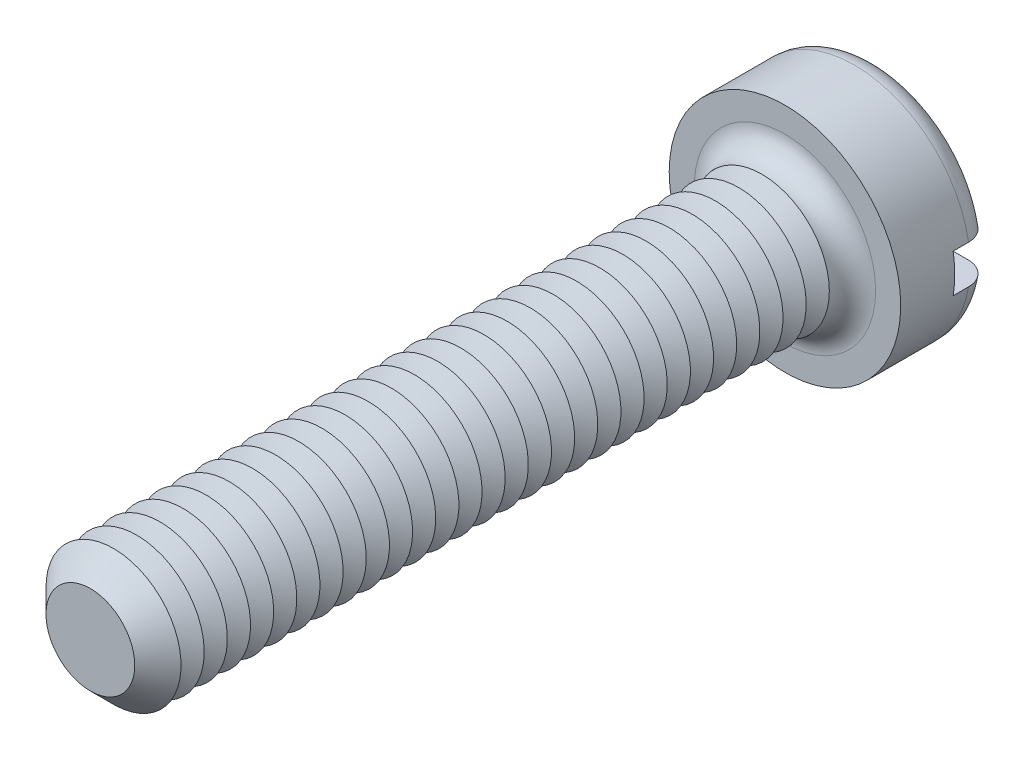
from build123d import *

# Parameters (mm, degrees)
SKETCH3_R           = 3
BOSS_EXTRUDE2_DEPTH = 2.4
SKETCH4_R           = 1.75
BOSS_EXTRUDE3_DEPTH = 18
FILLET1_R           = 0.6
CHAMFER1_SIZE       = 0.6
LPATTERN1_COUNT     = 28
LPATTERN1_PITCH     = 0.6
SKETCH8_W           = 6
SKETCH8_H           = 1
CUT_EXTRUDE1_DEPTH  = 1


with BuildPart() as part:
    # Sketch3 → Boss-Extrude2 (new body)
    with BuildSketch(Plane.XY):
        Circle(SKETCH3_R)
    extrude(amount=-BOSS_EXTRUDE2_DEPTH)

    # Sketch4 → Boss-Extrude3 (add)
    with BuildSketch(Plane.XY):
        Circle(SKETCH4_R)
    extrude(amount=BOSS_EXTRUDE3_DEPTH)

    # Fillet1
    fillet1_edges = [part.edges().sort_by_distance(p)[0] for p in [
        (-3, 0, -2.4),
        (-1.75, 0, 0),
    ]]
    fillet(fillet1_edges, radius=FILLET1_R)

    # Chamfer1
    chamfer1_edges = [part.edges().sort_by_distance(p)[0] for p in [
        (-1.75, 0, 18),
    ]]
    chamfer(chamfer1_edges, length=CHAMFER1_SIZE)

    # Sketch6 → Cut-Revolve1 (revolve, cut)
    with BuildSketch(Plane(origin=(0, 0, 0), x_dir=(0, 0, -1), z_dir=(1, 0, 0)), mode=Mode.PRIVATE) as cut_revolve1_sk:
        Polygon((-0.6, 1.75), (-0.9, 1.230384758), (-1.2, 1.75), align=None)
    cut_revolve1 = revolve(cut_revolve1_sk.sketch.rotate(Axis((0, 0, -1.694361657), (0, 0, 1)), 90), axis=Axis((0, 0, -1.694361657), (0, 0, 1)), mode=Mode.SUBTRACT)

    # LPattern1: Cut-Revolve1 ×28
    with Locations(*[(0, 0, i * LPATTERN1_PITCH) for i in range(1, LPATTERN1_COUNT)]):
        add(cut_revolve1, mode=Mode.SUBTRACT)

    # Sketch8 → Cut-Extrude1 (cut)
    with BuildSketch(Plane(origin=(0, 0, -2.4), x_dir=(-1, 0, 0), z_dir=(0, 0, -1))):
        Rectangle(SKETCH8_W, SKETCH8_H)
    extrude(amount=-CUT_EXTRUDE1_DEPTH, mode=Mode.SUBTRACT)


solid = part.part
